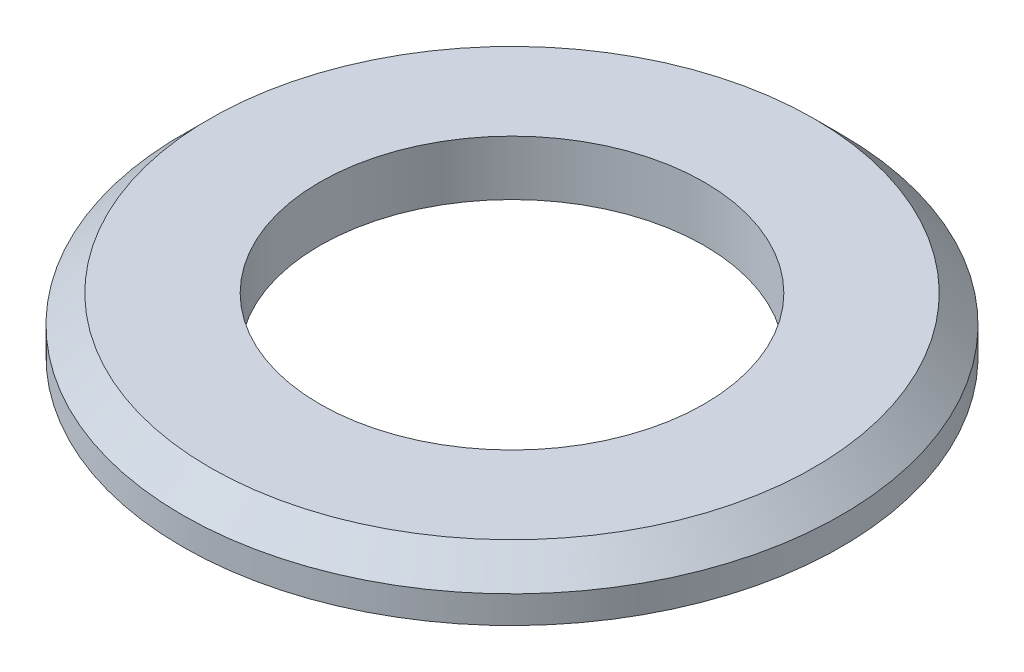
ISO-10303-21;
HEADER;
FILE_DESCRIPTION(('STEP AP214'),'2;1');
FILE_NAME('part.step','',(''),(''),'','','');
FILE_SCHEMA(('AUTOMOTIVE_DESIGN { 1 0 10303 214 1 1 1 1 }'));
ENDSEC;
DATA;
#1=APPLICATION_CONTEXT('core data for automotive mechanical design processes');
#2=APPLICATION_PROTOCOL_DEFINITION('international standard','automotive_design',2000,#1);
#3=PRODUCT_CONTEXT('',#1,'mechanical');
#4=PRODUCT('Part','Part','',(#3));
#5=PRODUCT_RELATED_PRODUCT_CATEGORY('part','',(#4));
#6=PRODUCT_DEFINITION_FORMATION('','',#4);
#7=PRODUCT_DEFINITION_CONTEXT('part definition',#1,'design');
#8=PRODUCT_DEFINITION('design','',#6,#7);
#9=PRODUCT_DEFINITION_SHAPE('','',#8);
#10=(LENGTH_UNIT() NAMED_UNIT(*) SI_UNIT(.MILLI.,.METRE.));
#11=(NAMED_UNIT(*) PLANE_ANGLE_UNIT() SI_UNIT($,.RADIAN.));
#12=(NAMED_UNIT(*) SI_UNIT($,.STERADIAN.) SOLID_ANGLE_UNIT());
#13=UNCERTAINTY_MEASURE_WITH_UNIT(LENGTH_MEASURE(1.E-05),#10,'distance_accuracy_value','');
#14=(GEOMETRIC_REPRESENTATION_CONTEXT(3) GLOBAL_UNCERTAINTY_ASSIGNED_CONTEXT((#13)) GLOBAL_UNIT_ASSIGNED_CONTEXT((#10,
#11,#12)) REPRESENTATION_CONTEXT('',''));
#15=CARTESIAN_POINT('',(0.,0.,0.));
#16=DIRECTION('',(0.,0.,1.));
#17=DIRECTION('',(1.,0.,0.));
#18=AXIS2_PLACEMENT_3D('',#15,#16,#17);
#19=CARTESIAN_POINT('',(0.,10.,0.));
#20=DIRECTION('',(0.,1.,0.));
#21=DIRECTION('',(0.,0.,1.));
#22=AXIS2_PLACEMENT_3D('',#19,#20,#21);
#23=PLANE('',#22);
#24=CARTESIAN_POINT('',(0.,10.,0.));
#25=DIRECTION('',(0.,1.,0.));
#26=DIRECTION('',(0.,0.,1.));
#27=AXIS2_PLACEMENT_3D('',#24,#25,#26);
#28=CIRCLE('',#27,55.);
#29=CARTESIAN_POINT('',(0.,10.,55.));
#30=VERTEX_POINT('',#29);
#31=EDGE_CURVE('E35',#30,#30,#28,.T.);
#32=ORIENTED_EDGE('',*,*,#31,.T.);
#33=EDGE_LOOP('',(#32));
#34=FACE_BOUND('',#33,.T.);
#35=CARTESIAN_POINT('',(0.,10.,0.));
#36=DIRECTION('',(0.,1.,0.));
#37=DIRECTION('',(0.,0.,1.));
#38=AXIS2_PLACEMENT_3D('',#35,#36,#37);
#39=CIRCLE('',#38,35.);
#40=CARTESIAN_POINT('',(0.,10.,35.));
#41=VERTEX_POINT('',#40);
#42=EDGE_CURVE('E43',#41,#41,#39,.T.);
#43=ORIENTED_EDGE('',*,*,#42,.F.);
#44=EDGE_LOOP('',(#43));
#45=FACE_BOUND('',#44,.T.);
#46=ADVANCED_FACE('F28',(#34,#45),#23,.T.);
#47=CARTESIAN_POINT('',(0.,0.,0.));
#48=DIRECTION('',(0.,1.,0.));
#49=DIRECTION('',(0.,0.,1.));
#50=AXIS2_PLACEMENT_3D('',#47,#48,#49);
#51=PLANE('',#50);
#52=CARTESIAN_POINT('',(0.,0.,0.));
#53=DIRECTION('',(0.,1.,0.));
#54=DIRECTION('',(0.,0.,1.));
#55=AXIS2_PLACEMENT_3D('',#52,#53,#54);
#56=CIRCLE('',#55,60.);
#57=CARTESIAN_POINT('',(0.,0.,60.));
#58=VERTEX_POINT('',#57);
#59=EDGE_CURVE('E39',#58,#58,#56,.T.);
#60=ORIENTED_EDGE('',*,*,#59,.F.);
#61=EDGE_LOOP('',(#60));
#62=FACE_BOUND('',#61,.T.);
#63=CARTESIAN_POINT('',(0.,0.,0.));
#64=DIRECTION('',(0.,1.,0.));
#65=DIRECTION('',(0.,0.,1.));
#66=AXIS2_PLACEMENT_3D('',#63,#64,#65);
#67=CIRCLE('',#66,35.);
#68=CARTESIAN_POINT('',(0.,0.,35.));
#69=VERTEX_POINT('',#68);
#70=EDGE_CURVE('E48',#69,#69,#67,.T.);
#71=ORIENTED_EDGE('',*,*,#70,.T.);
#72=EDGE_LOOP('',(#71));
#73=FACE_BOUND('',#72,.T.);
#74=ADVANCED_FACE('F52',(#62,#73),#51,.F.);
#75=CARTESIAN_POINT('',(0.,10.,0.));
#76=DIRECTION('',(0.,-1.,0.));
#77=DIRECTION('',(0.,0.,-1.));
#78=AXIS2_PLACEMENT_3D('',#75,#76,#77);
#79=CYLINDRICAL_SURFACE('',#78,60.);
#80=CARTESIAN_POINT('',(0.,4.99999999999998,0.));
#81=DIRECTION('',(0.,1.,0.));
#82=DIRECTION('',(0.,0.,1.));
#83=AXIS2_PLACEMENT_3D('',#80,#81,#82);
#84=CIRCLE('',#83,60.);
#85=CARTESIAN_POINT('',(0.,4.99999999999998,60.));
#86=VERTEX_POINT('',#85);
#87=EDGE_CURVE('E10',#86,#86,#84,.F.);
#88=ORIENTED_EDGE('',*,*,#87,.T.);
#89=EDGE_LOOP('',(#88));
#90=FACE_BOUND('',#89,.T.);
#91=ORIENTED_EDGE('',*,*,#59,.T.);
#92=EDGE_LOOP('',(#91));
#93=FACE_BOUND('',#92,.T.);
#94=ADVANCED_FACE('F30',(#90,#93),#79,.T.);
#95=CARTESIAN_POINT('',(0.,10.,0.));
#96=DIRECTION('',(0.,-1.,0.));
#97=DIRECTION('',(0.,0.,-1.));
#98=AXIS2_PLACEMENT_3D('',#95,#96,#97);
#99=CYLINDRICAL_SURFACE('',#98,35.);
#100=ORIENTED_EDGE('',*,*,#42,.T.);
#101=EDGE_LOOP('',(#100));
#102=FACE_BOUND('',#101,.T.);
#103=ORIENTED_EDGE('',*,*,#70,.F.);
#104=EDGE_LOOP('',(#103));
#105=FACE_BOUND('',#104,.T.);
#106=ADVANCED_FACE('F54',(#102,#105),#99,.F.);
#107=CARTESIAN_POINT('',(0.,10.,0.));
#108=DIRECTION('',(0.,-1.,0.));
#109=DIRECTION('',(0.,0.,-1.));
#110=AXIS2_PLACEMENT_3D('',#107,#108,#109);
#111=CONICAL_SURFACE('',#110,55.,0.785398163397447);
#112=ORIENTED_EDGE('',*,*,#87,.F.);
#113=EDGE_LOOP('',(#112));
#114=FACE_BOUND('',#113,.T.);
#115=ORIENTED_EDGE('',*,*,#31,.F.);
#116=EDGE_LOOP('',(#115));
#117=FACE_BOUND('',#116,.T.);
#118=ADVANCED_FACE('F56',(#114,#117),#111,.T.);
#119=CLOSED_SHELL('',(#46,#74,#94,#106,#118));
#120=MANIFOLD_SOLID_BREP('B2',#119);
#121=ADVANCED_BREP_SHAPE_REPRESENTATION('',(#18,#120),#14);
#122=SHAPE_DEFINITION_REPRESENTATION(#9,#121);
ENDSEC;
END-ISO-10303-21;
